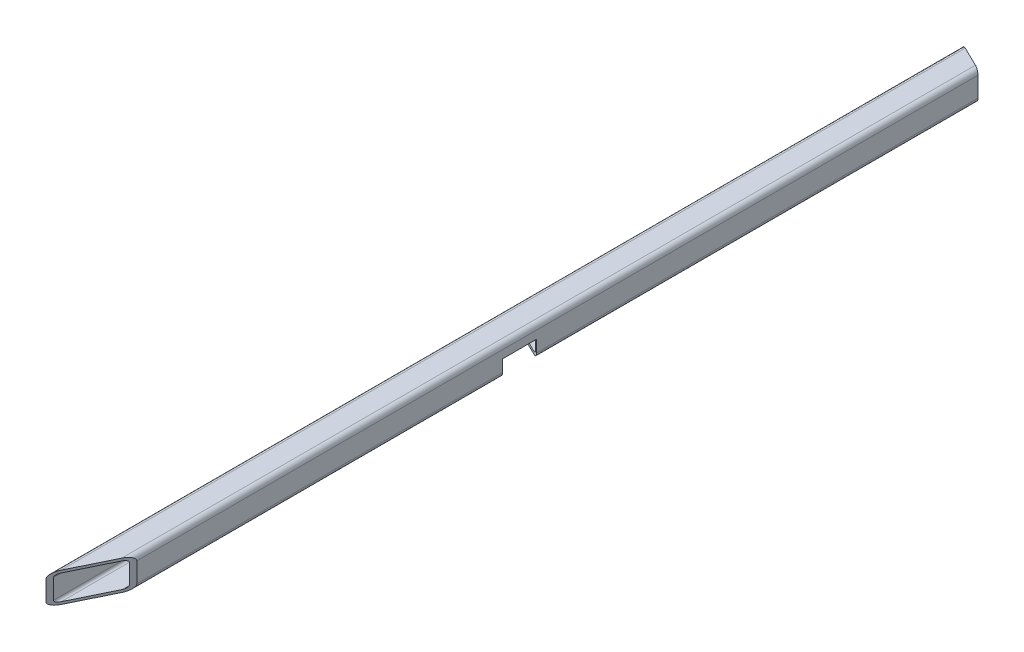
from build123d import *

# Parameters (mm, degrees)
EXTRUSION1_DEPTH = 1847.32
EXTRUSION2_DEPTH = 1849.537579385
EXTRUSION3_DEPTH = 1849.537579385
EXTRUSION5_DEPTH = 34


with BuildPart() as part:
    # Sketch1 → Extrusion1 (new body)
    with BuildSketch(Plane.XY):
        with BuildLine():
            Line((-20, -30), (20, -30))
            ThreePointArc((20, -30), (27.071067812, -27.071067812), (30, -20))
            Line((30, -20), (30, 20))
            ThreePointArc((30, 20), (27.071067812, 27.071067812), (20, 30))
            Line((20, 30), (-20, 30))
            ThreePointArc((-20, 30), (-27.071067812, 27.071067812), (-30, 20))
            Line((-30, 20), (-30, -20))
            ThreePointArc((-30, -20), (-27.071067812, -27.071067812), (-20, -30))
        make_face()
        with BuildLine():
            Line((-20, -25), (20, -25))
            ThreePointArc((20, -25), (23.535533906, -23.535533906), (25, -20))
            Line((25, -20), (25, 20))
            ThreePointArc((25, 20), (23.535533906, 23.535533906), (20, 25))
            Line((20, 25), (-20, 25))
            ThreePointArc((-20, 25), (-23.535533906, 23.535533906), (-25, 20))
            Line((-25, 20), (-25, -20))
            ThreePointArc((-25, -20), (-23.535533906, -23.535533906), (-20, -25))
        make_face(mode=Mode.SUBTRACT)
    extrude(amount=EXTRUSION1_DEPTH)

    # Esquisse1 → Extrusion2 (cut, through all)
    with BuildSketch(Plane(origin=(0, 30, 0), x_dir=(-1, 0, 0), z_dir=(0, 1, 0))):
        Polygon((-30, 1847.32), (30, 1847.32), (-30, 1724.301769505), align=None)
    extrude(amount=-EXTRUSION2_DEPTH, mode=Mode.SUBTRACT)

    # Esquisse2 → Extrusion3 (cut, through all)
    with BuildSketch(Plane(origin=(0, 30, 0), x_dir=(1, 0, 0), z_dir=(0, 1, 0))):
        Polygon((-30, 0), (30, 0), (30, -29.263955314), align=None)
    extrude(amount=-EXTRUSION3_DEPTH, mode=Mode.SUBTRACT)

    # Esquisse4 → Extrusion5 (cut)
    with BuildSketch(Plane.XZ.offset(30)):
        Polygon((-147.490968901, 901.046875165), (94.922385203, 1019.279767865), (122.101396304, 963.554536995), (-120.3119578, 845.321644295), align=None)
    extrude(amount=-EXTRUSION5_DEPTH, mode=Mode.SUBTRACT)


solid = part.part
